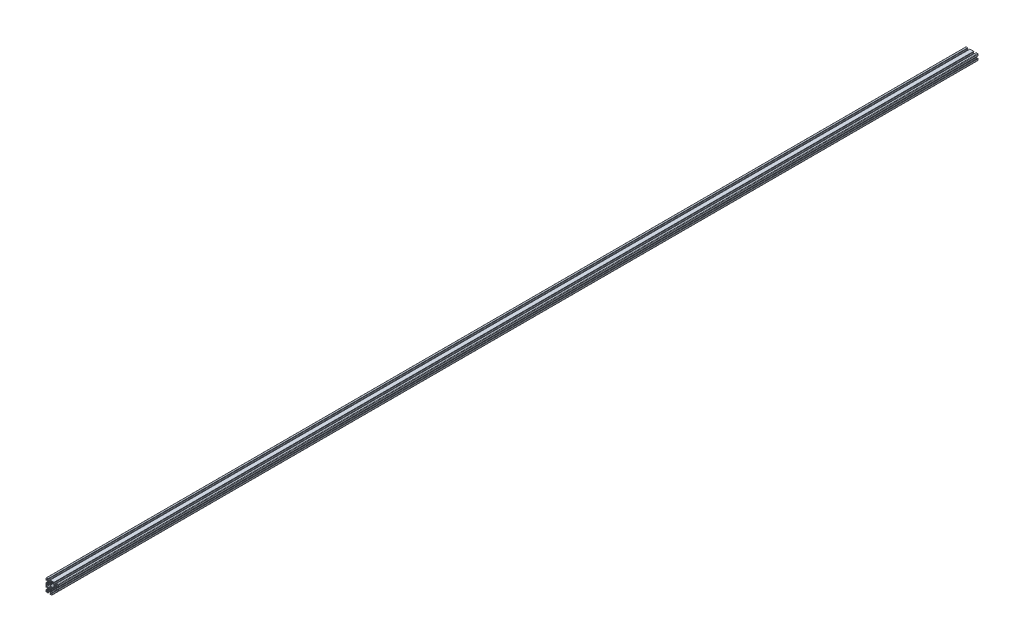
from build123d import *

# Parameters (mm, degrees)
EXTRUDE1_DEPTH = 3000


with BuildPart() as part:
    # Sketch1 → Extrude1 (new body)
    with BuildSketch(Plane.XY):
        with BuildLine():
            ThreePointArc((-3.349999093, 9.500000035), (-3.491420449, 9.558578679), (-3.549999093, 9.700000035))
            Line((-3.549999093, 9.700000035), (-3.549999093, 9.8))
            ThreePointArc((-3.549999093, 9.8), (-3.608577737, 9.941421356), (-3.749999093, 10))
            Line((-3.749999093, 10), (-8.5, 10))
            ThreePointArc((-8.5, 10), (-9.560660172, 9.560660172), (-10, 8.5))
            Line((-10, 8.5), (-10, 3.74999686))
            ThreePointArc((-10, 3.74999686), (-9.941421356, 3.608575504), (-9.8, 3.54999686))
            Line((-9.8, 3.54999686), (-9.699999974, 3.54999686))
            ThreePointArc((-9.699999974, 3.54999686), (-9.558578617, 3.491418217), (-9.499999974, 3.34999686))
            Line((-9.499999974, 3.34999686), (-9.499999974, 3.2))
            ThreePointArc((-9.499999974, 3.2), (-9.44142133, 3.058578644), (-9.299999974, 3))
            Line((-9.299999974, 3), (-9.000000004, 3))
            ThreePointArc((-9.000000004, 3), (-8.646446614, 3.146446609), (-8.500000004, 3.5))
            Line((-8.500000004, 3.5), (-8.500000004, 5.499996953))
            ThreePointArc((-8.500000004, 5.499996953), (-8.353553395, 5.853550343), (-8.000000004, 5.999996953))
            Line((-8.000000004, 5.999996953), (-7.267766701, 5.999996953))
            ThreePointArc((-7.267766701, 5.999996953), (-7.076425, 5.961936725), (-6.914213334, 5.853550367))
            Line((-6.914213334, 5.853550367), (-4.646446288, 3.58578362))
            ThreePointArc((-4.646446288, 3.58578362), (-4.538059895, 3.423571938), (-4.499999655, 3.232230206))
            Line((-4.499999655, 3.232230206), (-4.499999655, 0.953586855))
            ThreePointArc((-4.499999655, 0.953586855), (-4.493184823, 0.901823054), (-4.473204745, 0.85358687))
            Line((-4.473204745, 0.85358687), (-4.038120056, 0.099997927))
            ThreePointArc((-4.038120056, 0.099997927), (-4.011325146, -2.058e-06), (-4.038120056, -0.100002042))
            Line((-4.038120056, -0.100002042), (-4.473204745, -0.853590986))
            ThreePointArc((-4.473204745, -0.853590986), (-4.493184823, -0.90182717), (-4.499999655, -0.95359097))
            Line((-4.499999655, -0.95359097), (-4.499999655, -3.232234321))
            ThreePointArc((-4.499999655, -3.232234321), (-4.538059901, -3.423576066), (-4.646446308, -3.585787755))
            Line((-4.646446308, -3.585787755), (-6.91421348, -5.853554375))
            ThreePointArc((-6.91421348, -5.853554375), (-7.076425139, -5.961940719), (-7.267766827, -6.000000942))
            Line((-7.267766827, -6.000000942), (-8.000000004, -6.000000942))
            ThreePointArc((-8.000000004, -6.000000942), (-8.353553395, -5.853554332), (-8.500000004, -5.500000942))
            Line((-8.500000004, -5.500000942), (-8.500000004, -3.5))
            ThreePointArc((-8.500000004, -3.5), (-8.646446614, -3.146446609), (-9.000000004, -3))
            Line((-9.000000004, -3), (-9.299999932, -3))
            ThreePointArc((-9.299999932, -3), (-9.441421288, -3.058578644), (-9.499999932, -3.2))
            Line((-9.499999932, -3.2), (-9.499999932, -3.350000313))
            ThreePointArc((-9.499999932, -3.350000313), (-9.558578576, -3.491421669), (-9.699999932, -3.550000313))
            Line((-9.699999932, -3.550000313), (-9.8, -3.550000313))
            ThreePointArc((-9.8, -3.550000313), (-9.941421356, -3.608578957), (-10, -3.750000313))
            Line((-10, -3.750000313), (-10, -16.250001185))
            ThreePointArc((-10, -16.250001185), (-9.941421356, -16.391422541), (-9.8, -16.450001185))
            Line((-9.8, -16.450001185), (-9.699999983, -16.450001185))
            ThreePointArc((-9.699999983, -16.450001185), (-9.558578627, -16.508579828), (-9.499999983, -16.650001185))
            Line((-9.499999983, -16.650001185), (-9.499999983, -16.8))
            ThreePointArc((-9.499999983, -16.8), (-9.44142134, -16.941421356), (-9.299999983, -17))
            Line((-9.299999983, -17), (-9.000000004, -17))
            ThreePointArc((-9.000000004, -17), (-8.646446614, -16.853553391), (-8.500000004, -16.5))
            Line((-8.500000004, -16.5), (-8.500000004, -14.500001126))
            ThreePointArc((-8.500000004, -14.500001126), (-8.353553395, -14.146447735), (-8.000000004, -14.000001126))
            Line((-8.000000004, -14.000001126), (-7.267766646, -14.000001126))
            ThreePointArc((-7.267766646, -14.000001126), (-7.07642494, -14.038061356), (-6.91421327, -14.146447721))
            Line((-6.91421327, -14.146447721), (-4.646446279, -16.414214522))
            ThreePointArc((-4.646446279, -16.414214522), (-4.538059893, -16.576426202), (-4.499999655, -16.767767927))
            Line((-4.499999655, -16.767767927), (-4.499999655, -19.046411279))
            ThreePointArc((-4.499999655, -19.046411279), (-4.493184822, -19.098175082), (-4.473204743, -19.146411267))
            Line((-4.473204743, -19.146411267), (-4.038120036, -19.9000002))
            ThreePointArc((-4.038120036, -19.9000002), (-4.011325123, -20.000000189), (-4.038120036, -20.100000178))
            Line((-4.038120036, -20.100000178), (-4.473204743, -20.853589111))
            ThreePointArc((-4.473204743, -20.853589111), (-4.493184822, -20.901825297), (-4.499999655, -20.953589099))
            Line((-4.499999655, -20.953589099), (-4.499999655, -23.232232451))
            ThreePointArc((-4.499999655, -23.232232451), (-4.53805988, -23.423574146), (-4.646446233, -23.585785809))
            Line((-4.646446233, -23.585785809), (-6.914212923, -25.853552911))
            ThreePointArc((-6.914212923, -25.853552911), (-7.076424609, -25.96193931), (-7.267766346, -25.999999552))
            Line((-7.267766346, -25.999999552), (-8.000000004, -25.999999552))
            ThreePointArc((-8.000000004, -25.999999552), (-8.353553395, -25.853552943), (-8.500000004, -25.499999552))
            Line((-8.500000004, -25.499999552), (-8.500000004, -23.5))
            ThreePointArc((-8.500000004, -23.5), (-8.646446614, -23.146446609), (-9.000000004, -23))
            Line((-9.000000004, -23), (-9.300000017, -23))
            ThreePointArc((-9.300000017, -23), (-9.441421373, -23.058578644), (-9.500000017, -23.2))
            Line((-9.500000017, -23.2), (-9.500000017, -23.349999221))
            ThreePointArc((-9.500000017, -23.349999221), (-9.55857866, -23.491420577), (-9.700000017, -23.549999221))
            Line((-9.700000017, -23.549999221), (-9.8, -23.549999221))
            ThreePointArc((-9.8, -23.549999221), (-9.941421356, -23.608577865), (-10, -23.749999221))
            Line((-10, -23.749999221), (-10, -28.5))
            ThreePointArc((-10, -28.5), (-9.560660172, -29.560660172), (-8.5, -30))
            Line((-8.5, -30), (-3.7, -30))
            ThreePointArc((-3.7, -30), (-3.558578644, -29.941421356), (-3.5, -29.8))
            Line((-3.5, -29.8), (-3.5, -29.700000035))
            ThreePointArc((-3.5, -29.700000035), (-3.441421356, -29.558578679), (-3.3, -29.500000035))
            Line((-3.3, -29.500000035), (-3.2, -29.500000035))
            ThreePointArc((-3.2, -29.500000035), (-3.058578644, -29.441421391), (-3, -29.300000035))
            Line((-3, -29.300000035), (-3, -28.999999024))
            ThreePointArc((-3, -28.999999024), (-3.146446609, -28.646445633), (-3.5, -28.499999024))
            Line((-3.5, -28.499999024), (-5.499999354, -28.499999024))
            ThreePointArc((-5.499999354, -28.499999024), (-5.853552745, -28.353552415), (-5.999999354, -27.999999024))
            Line((-5.999999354, -27.999999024), (-5.999999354, -27.267766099))
            ThreePointArc((-5.999999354, -27.267766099), (-5.961939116, -27.076424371), (-5.853552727, -26.914212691))
            Line((-5.853552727, -26.914212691), (-3.585785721, -24.646445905))
            ThreePointArc((-3.585785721, -24.646445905), (-3.423574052, -24.538059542), (-3.232232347, -24.499999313))
            Line((-3.232232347, -24.499999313), (-0.953588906, -24.499999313))
            ThreePointArc((-0.953588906, -24.499999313), (-0.9018251, -24.493184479), (-0.853588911, -24.473204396))
            Line((-0.853588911, -24.473204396), (-0.099999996, -24.038119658))
            ThreePointArc((-0.099999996, -24.038119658), (5e-09, -24.011324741), (0.100000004, -24.038119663))
            Line((0.100000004, -24.038119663), (0.853588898, -24.473204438))
            ThreePointArc((0.853588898, -24.473204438), (0.901825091, -24.493184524), (0.953588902, -24.49999936))
            Line((0.953588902, -24.49999936), (3.232232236, -24.49999936))
            ThreePointArc((3.232232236, -24.49999936), (3.423573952, -24.538059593), (3.585785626, -24.646445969))
            Line((3.585785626, -24.646445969), (5.853552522, -26.914212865))
            ThreePointArc((5.853552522, -26.914212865), (5.961938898, -27.07642454), (5.999999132, -27.267766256))
            Line((5.999999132, -27.267766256), (5.999999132, -27.999999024))
            ThreePointArc((5.999999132, -27.999999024), (5.853552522, -28.353552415), (5.499999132, -28.499999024))
            Line((5.499999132, -28.499999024), (3.5, -28.499999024))
            ThreePointArc((3.5, -28.499999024), (3.146446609, -28.646445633), (3, -28.999999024))
            Line((3, -28.999999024), (3, -29.299999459))
            ThreePointArc((3, -29.299999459), (3.058578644, -29.441420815), (3.2, -29.499999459))
            Line((3.2, -29.499999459), (3.299999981, -29.499999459))
            ThreePointArc((3.299999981, -29.499999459), (3.441421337, -29.558578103), (3.499999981, -29.699999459))
            Line((3.499999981, -29.699999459), (3.499999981, -29.8))
            ThreePointArc((3.499999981, -29.8), (3.558578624, -29.941421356), (3.699999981, -30))
            Line((3.699999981, -30), (8.5, -30))
            ThreePointArc((8.5, -30), (9.560660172, -29.560660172), (10, -28.5))
            Line((10, -28.5), (10, -23.700000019))
            ThreePointArc((10, -23.700000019), (9.941421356, -23.558578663), (9.8, -23.500000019))
            Line((9.8, -23.500000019), (9.700000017, -23.500000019))
            ThreePointArc((9.700000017, -23.500000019), (9.55857866, -23.441421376), (9.500000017, -23.300000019))
            Line((9.500000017, -23.300000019), (9.500000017, -23.2))
            ThreePointArc((9.500000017, -23.2), (9.441421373, -23.058578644), (9.300000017, -23))
            Line((9.300000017, -23), (9.000000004, -23))
            ThreePointArc((9.000000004, -23), (8.646446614, -23.146446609), (8.500000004, -23.5))
            Line((8.500000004, -23.5), (8.500000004, -25.499999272))
            ThreePointArc((8.500000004, -25.499999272), (8.353553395, -25.853552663), (8.000000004, -25.999999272))
            Line((8.000000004, -25.999999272), (7.267766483, -25.999999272))
            ThreePointArc((7.267766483, -25.999999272), (7.076424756, -25.961939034), (6.914213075, -25.853552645))
            Line((6.914213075, -25.853552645), (4.64644629, -23.585785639))
            ThreePointArc((4.64644629, -23.585785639), (4.538059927, -23.42357397), (4.499999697, -23.232232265))
            Line((4.499999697, -23.232232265), (4.499999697, -20.953588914))
            ThreePointArc((4.499999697, -20.953588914), (4.493184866, -20.901825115), (4.473204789, -20.853588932))
            Line((4.473204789, -20.853588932), (4.038120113, -20.099999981))
            ThreePointArc((4.038120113, -20.099999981), (4.011325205, -20), (4.038120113, -19.900000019))
            Line((4.038120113, -19.900000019), (4.473204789, -19.146411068))
            ThreePointArc((4.473204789, -19.146411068), (4.493184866, -19.098174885), (4.499999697, -19.046411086))
            Line((4.499999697, -19.046411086), (4.499999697, -16.767767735))
            ThreePointArc((4.499999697, -16.767767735), (4.538059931, -16.576426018), (4.646446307, -16.414214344))
            Line((4.646446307, -16.414214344), (6.914213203, -14.146447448))
            ThreePointArc((6.914213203, -14.146447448), (7.076424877, -14.038061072), (7.267766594, -14.000000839))
            Line((7.267766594, -14.000000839), (8.000000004, -14.000000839))
            ThreePointArc((8.000000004, -14.000000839), (8.353553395, -14.146447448), (8.500000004, -14.500000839))
            Line((8.500000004, -14.500000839), (8.500000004, -16.5))
            ThreePointArc((8.500000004, -16.5), (8.646446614, -16.853553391), (9.000000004, -17))
            Line((9.000000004, -17), (9.299999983, -17))
            ThreePointArc((9.299999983, -17), (9.44142134, -16.941421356), (9.499999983, -16.8))
            Line((9.499999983, -16.8), (9.499999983, -16.700000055))
            ThreePointArc((9.499999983, -16.700000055), (9.558578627, -16.558578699), (9.699999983, -16.500000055))
            Line((9.699999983, -16.500000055), (9.8, -16.500000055))
            ThreePointArc((9.8, -16.500000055), (9.941421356, -16.441421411), (10, -16.300000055))
            Line((10, -16.300000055), (10, -11.5))
            ThreePointArc((10, -11.5), (10.439339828, -10.439339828), (11.5, -10))
            Line((11.5, -10), (16.250000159, -10))
            ThreePointArc((16.250000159, -10), (16.391421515, -9.941421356), (16.450000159, -9.8))
            Line((16.450000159, -9.8), (16.450000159, -9.699999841))
            ThreePointArc((16.450000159, -9.699999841), (16.508578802, -9.558578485), (16.650000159, -9.499999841))
            Line((16.650000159, -9.499999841), (16.8, -9.499999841))
            ThreePointArc((16.8, -9.499999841), (16.941421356, -9.441421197), (17, -9.299999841))
            Line((17, -9.299999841), (17, -8.999999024))
            ThreePointArc((17, -8.999999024), (16.853553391, -8.646445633), (16.5, -8.499999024))
            Line((16.5, -8.499999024), (14.500002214, -8.499999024))
            ThreePointArc((14.500002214, -8.499999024), (14.146448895, -8.353552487), (14.000002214, -7.999999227))
            Line((14.000002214, -7.999999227), (14.000001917, -7.267767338))
            ThreePointArc((14.000001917, -7.267767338), (14.038062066, -7.076425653), (14.146448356, -6.914213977))
            Line((14.146448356, -6.914213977), (16.414214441, -4.646446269))
            ThreePointArc((16.414214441, -4.646446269), (16.576426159, -4.538059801), (16.767767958, -4.499999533))
            Line((16.767767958, -4.499999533), (19.046411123, -4.499999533))
            ThreePointArc((19.046411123, -4.499999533), (19.098174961, -4.493184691), (19.146411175, -4.473204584))
            Line((19.146411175, -4.473204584), (19.899999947, -4.038119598))
            ThreePointArc((19.899999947, -4.038119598), (20, -4.011324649), (20.100000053, -4.038119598))
            Line((20.100000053, -4.038119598), (20.853588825, -4.473204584))
            ThreePointArc((20.853588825, -4.473204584), (20.901825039, -4.493184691), (20.953588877, -4.499999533))
            Line((20.953588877, -4.499999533), (23.232232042, -4.499999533))
            ThreePointArc((23.232232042, -4.499999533), (23.423573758, -4.538059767), (23.585785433, -4.646446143))
            Line((23.585785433, -4.646446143), (25.853552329, -6.914213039))
            ThreePointArc((25.853552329, -6.914213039), (25.961938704, -7.076424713), (25.999998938, -7.26776643))
            Line((25.999998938, -7.26776643), (25.999998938, -7.999999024))
            ThreePointArc((25.999998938, -7.999999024), (25.853552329, -8.353552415), (25.499998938, -8.499999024))
            Line((25.499998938, -8.499999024), (23.5, -8.499999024))
            ThreePointArc((23.5, -8.499999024), (23.146446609, -8.646445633), (23, -8.999999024))
            Line((23, -8.999999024), (23, -9.3))
            ThreePointArc((23, -9.3), (23.058578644, -9.441421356), (23.2, -9.5))
            Line((23.2, -9.5), (23.3, -9.5))
            ThreePointArc((23.3, -9.5), (23.441421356, -9.558578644), (23.5, -9.7))
            Line((23.5, -9.7), (23.5, -9.8))
            ThreePointArc((23.5, -9.8), (23.558578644, -9.941421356), (23.7, -10))
            Line((23.7, -10), (28.5, -10))
            ThreePointArc((28.5, -10), (29.560660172, -9.560660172), (30, -8.5))
            Line((30, -8.5), (30, -3.699999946))
            ThreePointArc((30, -3.699999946), (29.941421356, -3.55857859), (29.8, -3.499999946))
            Line((29.8, -3.499999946), (29.699999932, -3.499999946))
            ThreePointArc((29.699999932, -3.499999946), (29.558578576, -3.441421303), (29.499999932, -3.299999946))
            Line((29.499999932, -3.299999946), (29.499999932, -3.2))
            ThreePointArc((29.499999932, -3.2), (29.441421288, -3.058578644), (29.299999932, -3))
            Line((29.299999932, -3), (29.000000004, -3))
            ThreePointArc((29.000000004, -3), (28.646446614, -3.146446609), (28.500000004, -3.5))
            Line((28.500000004, -3.5), (28.500000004, -5.499999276))
            ThreePointArc((28.500000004, -5.499999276), (28.353553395, -5.853552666), (28.000000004, -5.999999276))
            Line((28.000000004, -5.999999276), (27.26776694, -5.999999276))
            ThreePointArc((27.26776694, -5.999999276), (27.076425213, -5.961939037), (26.914213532, -5.853552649))
            Line((26.914213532, -5.853552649), (24.646446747, -3.585785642))
            ThreePointArc((24.646446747, -3.585785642), (24.538060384, -3.423573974), (24.500000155, -3.232232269))
            Line((24.500000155, -3.232232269), (24.500000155, -0.953588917))
            ThreePointArc((24.500000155, -0.953588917), (24.493185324, -0.901825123), (24.47320525, -0.853588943))
            Line((24.47320525, -0.853588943), (24.038120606, -0.099999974))
            ThreePointArc((24.038120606, -0.099999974), (24.011325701, 0), (24.038120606, 0.099999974))
            Line((24.038120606, 0.099999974), (24.47320525, 0.853588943))
            ThreePointArc((24.47320525, 0.853588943), (24.493185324, 0.901825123), (24.500000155, 0.953588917))
            Line((24.500000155, 0.953588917), (24.500000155, 3.232232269))
            ThreePointArc((24.500000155, 3.232232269), (24.538060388, 3.423573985), (24.646446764, 3.58578566))
            Line((24.646446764, 3.58578566), (26.91421366, 5.853552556))
            ThreePointArc((26.91421366, 5.853552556), (27.076425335, 5.961938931), (27.267767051, 5.999999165))
            Line((27.267767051, 5.999999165), (28.000000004, 5.999999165))
            ThreePointArc((28.000000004, 5.999999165), (28.353553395, 5.853552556), (28.500000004, 5.499999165))
            Line((28.500000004, 5.499999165), (28.500000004, 3.5))
            ThreePointArc((28.500000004, 3.5), (28.646446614, 3.146446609), (29.000000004, 3))
            Line((29.000000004, 3), (29.299999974, 3))
            ThreePointArc((29.299999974, 3), (29.44142133, 3.058578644), (29.499999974, 3.2))
            Line((29.499999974, 3.2), (29.499999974, 3.3))
            ThreePointArc((29.499999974, 3.3), (29.558578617, 3.441421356), (29.699999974, 3.5))
            Line((29.699999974, 3.5), (29.8, 3.5))
            ThreePointArc((29.8, 3.5), (29.941421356, 3.558578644), (30, 3.7))
            Line((30, 3.7), (30, 8.5))
            ThreePointArc((30, 8.5), (29.560660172, 9.560660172), (28.5, 10))
            Line((28.5, 10), (23.700000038, 10))
            ThreePointArc((23.700000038, 10), (23.558578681, 9.941421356), (23.500000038, 9.8))
            Line((23.500000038, 9.8), (23.500000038, 9.7))
            ThreePointArc((23.500000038, 9.7), (23.441421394, 9.558578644), (23.300000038, 9.5))
            Line((23.300000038, 9.5), (23.2, 9.5))
            ThreePointArc((23.2, 9.5), (23.058578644, 9.441421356), (23, 9.3))
            Line((23, 9.3), (23, 8.999999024))
            ThreePointArc((23, 8.999999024), (23.146446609, 8.646445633), (23.5, 8.499999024))
            Line((23.5, 8.499999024), (25.499997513, 8.499999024))
            ThreePointArc((25.499997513, 8.499999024), (25.853550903, 8.353552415), (25.999997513, 7.999999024))
            Line((25.999997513, 7.999999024), (25.999997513, 7.267767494))
            ThreePointArc((25.999997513, 7.267767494), (25.961937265, 7.076425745), (25.853550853, 6.914214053))
            Line((25.853550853, 6.914214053), (23.585783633, 4.64644748))
            ThreePointArc((23.585783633, 4.64644748), (23.423571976, 4.538061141), (23.232230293, 4.500000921))
            Line((23.232230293, 4.500000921), (20.953586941, 4.500000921))
            ThreePointArc((20.953586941, 4.500000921), (20.901823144, 4.49318609), (20.853586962, 4.473206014))
            Line((20.853586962, 4.473206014), (20.099998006, 4.038121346))
            ThreePointArc((20.099998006, 4.038121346), (19.999998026, 4.011326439), (19.899998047, 4.038121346))
            Line((19.899998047, 4.038121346), (19.146409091, 4.473206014))
            ThreePointArc((19.146409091, 4.473206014), (19.098172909, 4.49318609), (19.046409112, 4.500000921))
            Line((19.046409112, 4.500000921), (16.76776576, 4.500000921))
            ThreePointArc((16.76776576, 4.500000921), (16.576424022, 4.538061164), (16.414212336, 4.646447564))
            Line((16.414212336, 4.646447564), (14.146445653, 6.914214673))
            ThreePointArc((14.146445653, 6.914214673), (14.038059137, 7.076426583), (13.999998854, 7.267768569))
            Line((13.999998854, 7.267768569), (13.999998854, 7.999999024))
            ThreePointArc((13.999998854, 7.999999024), (14.146445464, 8.353552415), (14.499998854, 8.499999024))
            Line((14.499998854, 8.499999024), (16.5, 8.499999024))
            ThreePointArc((16.5, 8.499999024), (16.853553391, 8.646445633), (17, 8.999999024))
            Line((17, 8.999999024), (17, 9.299999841))
            ThreePointArc((17, 9.299999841), (16.941421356, 9.441421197), (16.8, 9.499999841))
            Line((16.8, 9.499999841), (16.599999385, 9.499999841))
            ThreePointArc((16.599999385, 9.499999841), (16.458578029, 9.558578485), (16.399999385, 9.699999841))
            Line((16.399999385, 9.699999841), (16.399999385, 9.799999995))
            ThreePointArc((16.399999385, 9.799999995), (16.341420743, 9.941421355), (16.199999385, 10))
            Line((16.199999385, 10), (3.700000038, 10))
            ThreePointArc((3.700000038, 10), (3.558578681, 9.941421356), (3.500000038, 9.8))
            Line((3.500000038, 9.8), (3.500000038, 9.699999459))
            ThreePointArc((3.500000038, 9.699999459), (3.441421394, 9.558578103), (3.300000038, 9.499999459))
            Line((3.300000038, 9.499999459), (3.2, 9.499999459))
            ThreePointArc((3.2, 9.499999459), (3.058578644, 9.441420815), (3, 9.299999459))
            Line((3, 9.299999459), (3, 8.999999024))
            ThreePointArc((3, 8.999999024), (3.146446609, 8.646445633), (3.5, 8.499999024))
            Line((3.5, 8.499999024), (5.499999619, 8.499999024))
            ThreePointArc((5.499999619, 8.499999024), (5.85355301, 8.353552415), (5.999999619, 7.999999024))
            Line((5.999999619, 7.999999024), (5.999999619, 7.267767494))
            ThreePointArc((5.999999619, 7.267767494), (5.961939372, 7.076425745), (5.853552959, 6.914214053))
            Line((5.853552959, 6.914214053), (3.585785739, 4.64644748))
            ThreePointArc((3.585785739, 4.64644748), (3.423574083, 4.538061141), (3.232232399, 4.500000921))
            Line((3.232232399, 4.500000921), (0.953589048, 4.500000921))
            ThreePointArc((0.953589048, 4.500000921), (0.90182525, 4.49318609), (0.853589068, 4.473206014))
            Line((0.853589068, 4.473206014), (0.100000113, 4.038121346))
            ThreePointArc((0.100000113, 4.038121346), (1.33e-07, 4.011326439), (-0.099999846, 4.038121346))
            Line((-0.099999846, 4.038121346), (-0.853588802, 4.473206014))
            ThreePointArc((-0.853588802, 4.473206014), (-0.901824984, 4.49318609), (-0.953588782, 4.500000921))
            Line((-0.953588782, 4.500000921), (-3.232232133, 4.500000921))
            ThreePointArc((-3.232232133, 4.500000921), (-3.423573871, 4.538061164), (-3.585785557, 4.646447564))
            Line((-3.585785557, 4.646447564), (-5.85355224, 6.914214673))
            ThreePointArc((-5.85355224, 6.914214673), (-5.961938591, 7.076426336), (-5.999998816, 7.267768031))
            Line((-5.999998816, 7.267768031), (-5.999998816, 7.999999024))
            ThreePointArc((-5.999998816, 7.999999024), (-5.853552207, 8.353552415), (-5.499998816, 8.499999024))
            Line((-5.499998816, 8.499999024), (-3.5, 8.499999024))
            ThreePointArc((-3.5, 8.499999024), (-3.146446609, 8.646445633), (-3, 8.999999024))
            Line((-3, 8.999999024), (-3, 9.300000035))
            ThreePointArc((-3, 9.300000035), (-3.058578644, 9.441421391), (-3.2, 9.500000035))
            Line((-3.2, 9.500000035), (-3.349999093, 9.500000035))
        make_face()
        with BuildLine():
            Line((2.891601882, 1.800596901), (2.525869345, 1.362297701))
            ThreePointArc((2.525869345, 1.362297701), (2.481166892, 1.260459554), (2.497774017, 1.150489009))
            ThreePointArc((2.497774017, 1.150489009), (2.75, 0), (2.497774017, -1.150489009))
            ThreePointArc((2.497774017, -1.150489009), (2.481166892, -1.260459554), (2.525869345, -1.362297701))
            Line((2.525869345, -1.362297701), (2.891601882, -1.800596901))
            ThreePointArc((2.891601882, -1.800596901), (2.937874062, -1.920565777), (2.90154698, -2.043910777))
            ThreePointArc((2.90154698, -2.043910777), (2.509635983, -2.509636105), (2.043910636, -2.90154708))
            ThreePointArc((2.043910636, -2.90154708), (1.920565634, -2.937874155), (1.80059676, -2.891601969))
            Line((1.80059676, -2.891601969), (1.362297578, -2.525869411))
            ThreePointArc((1.362297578, -2.525869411), (1.260459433, -2.481166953), (1.150488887, -2.497774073))
            ThreePointArc((1.150488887, -2.497774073), (0.003771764, -2.749997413), (-1.143632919, -2.50092058))
            ThreePointArc((-1.143632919, -2.50092058), (-1.253648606, -2.484615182), (-1.355363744, -2.529596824))
            Line((-1.355363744, -2.529596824), (-1.792658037, -2.896530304))
            ThreePointArc((-1.792658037, -2.896530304), (-1.91249953, -2.943131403), (-2.035943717, -2.907142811))
            ThreePointArc((-2.035943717, -2.907142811), (-2.506191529, -2.513075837), (-2.90154698, -2.043910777))
            ThreePointArc((-2.90154698, -2.043910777), (-2.937862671, -1.920291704), (-2.891249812, -1.80017615))
            Line((-2.891249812, -1.80017615), (-2.524316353, -1.362881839))
            ThreePointArc((-2.524316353, -1.362881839), (-2.480347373, -1.261339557), (-2.497095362, -1.151961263))
            ThreePointArc((-2.497095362, -1.151961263), (-2.74997358, 0.012054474), (-2.48690038, 1.173808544))
            ThreePointArc((-2.48690038, 1.173808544), (-2.481329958, 1.273149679), (-2.524316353, 1.362881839))
            Line((-2.524316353, 1.362881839), (-2.891249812, 1.80017615))
            ThreePointArc((-2.891249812, 1.80017615), (-2.937862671, 1.920291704), (-2.90154698, 2.043910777))
            ThreePointArc((-2.90154698, 2.043910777), (-2.509635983, 2.509636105), (-2.043910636, 2.90154708))
            ThreePointArc((-2.043910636, 2.90154708), (-1.920565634, 2.937874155), (-1.80059676, 2.891601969))
            Line((-1.80059676, 2.891601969), (-1.362297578, 2.525869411))
            ThreePointArc((-1.362297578, 2.525869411), (-1.260459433, 2.481166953), (-1.150488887, 2.497774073))
            ThreePointArc((-1.150488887, 2.497774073), (0, 2.75), (1.150488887, 2.497774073))
            ThreePointArc((1.150488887, 2.497774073), (1.260459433, 2.481166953), (1.362297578, 2.525869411))
            Line((1.362297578, 2.525869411), (1.80059676, 2.891601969))
            ThreePointArc((1.80059676, 2.891601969), (1.920565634, 2.937874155), (2.043910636, 2.90154708))
            ThreePointArc((2.043910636, 2.90154708), (2.509635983, 2.509636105), (2.90154698, 2.043910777))
            ThreePointArc((2.90154698, 2.043910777), (2.937874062, 1.920565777), (2.891601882, 1.800596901))
        make_face(mode=Mode.SUBTRACT)
        with BuildLine():
            Line((-1.80059676, -17.108398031), (-1.362297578, -17.474130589))
            ThreePointArc((-1.362297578, -17.474130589), (-1.260459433, -17.518833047), (-1.150488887, -17.502225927))
            ThreePointArc((-1.150488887, -17.502225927), (1.34e-07, -17.25), (1.150489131, -17.502226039))
            ThreePointArc((1.150489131, -17.502226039), (1.260459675, -17.51883317), (1.362297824, -17.474130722))
            Line((1.362297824, -17.474130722), (1.800597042, -17.108398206))
            ThreePointArc((1.800597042, -17.108398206), (1.92056592, -17.062126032), (2.043910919, -17.098453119))
            ThreePointArc((2.043910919, -17.098453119), (2.509636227, -17.49036414), (2.901547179, -17.956089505))
            ThreePointArc((2.901547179, -17.956089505), (2.937874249, -18.079434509), (2.891602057, -18.199403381))
            Line((2.891602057, -18.199403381), (2.525869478, -18.637702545))
            ThreePointArc((2.525869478, -18.637702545), (2.481167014, -18.739540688), (2.497774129, -18.849511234))
            ThreePointArc((2.497774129, -18.849511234), (2.75, -20.000000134), (2.497774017, -21.150489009))
            ThreePointArc((2.497774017, -21.150489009), (2.481166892, -21.260459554), (2.525869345, -21.362297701))
            Line((2.525869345, -21.362297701), (2.891601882, -21.800596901))
            ThreePointArc((2.891601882, -21.800596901), (2.937874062, -21.920565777), (2.90154698, -22.043910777))
            ThreePointArc((2.90154698, -22.043910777), (2.509635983, -22.509636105), (2.043910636, -22.90154708))
            ThreePointArc((2.043910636, -22.90154708), (1.920565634, -22.937874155), (1.80059676, -22.891601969))
            Line((1.80059676, -22.891601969), (1.362297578, -22.525869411))
            ThreePointArc((1.362297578, -22.525869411), (1.260459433, -22.481166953), (1.150488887, -22.497774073))
            ThreePointArc((1.150488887, -22.497774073), (-1.34e-07, -22.75), (-1.150489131, -22.497773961))
            ThreePointArc((-1.150489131, -22.497773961), (-1.260459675, -22.48116683), (-1.362297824, -22.525869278))
            Line((-1.362297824, -22.525869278), (-1.800597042, -22.891601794))
            ThreePointArc((-1.800597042, -22.891601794), (-1.92056592, -22.937873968), (-2.043910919, -22.901546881))
            ThreePointArc((-2.043910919, -22.901546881), (-2.509636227, -22.50963586), (-2.901547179, -22.043910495))
            ThreePointArc((-2.901547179, -22.043910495), (-2.937874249, -21.920565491), (-2.891602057, -21.800596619))
            Line((-2.891602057, -21.800596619), (-2.525869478, -21.362297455))
            ThreePointArc((-2.525869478, -21.362297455), (-2.481167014, -21.260459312), (-2.497774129, -21.150488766))
            ThreePointArc((-2.497774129, -21.150488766), (-2.75, -19.999999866), (-2.497774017, -18.849510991))
            ThreePointArc((-2.497774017, -18.849510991), (-2.481166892, -18.739540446), (-2.525869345, -18.637702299))
            Line((-2.525869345, -18.637702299), (-2.891601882, -18.199403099))
            ThreePointArc((-2.891601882, -18.199403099), (-2.937874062, -18.079434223), (-2.90154698, -17.956089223))
            ThreePointArc((-2.90154698, -17.956089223), (-2.509635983, -17.490363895), (-2.043910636, -17.09845292))
            ThreePointArc((-2.043910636, -17.09845292), (-1.920565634, -17.062125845), (-1.80059676, -17.108398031))
        make_face(mode=Mode.SUBTRACT)
        with BuildLine():
            ThreePointArc((-3.585784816, -4.646446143), (-3.423573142, -4.538059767), (-3.232231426, -4.499999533))
            Line((-3.232231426, -4.499999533), (-0.953588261, -4.499999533))
            ThreePointArc((-0.953588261, -4.499999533), (-0.901824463, -4.493184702), (-0.853588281, -4.473204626))
            Line((-0.853588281, -4.473204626), (-0.099999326, -4.038119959))
            ThreePointArc((-0.099999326, -4.038119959), (6.54e-07, -4.011325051), (0.100000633, -4.038119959))
            Line((0.100000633, -4.038119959), (0.853589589, -4.473204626))
            ThreePointArc((0.853589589, -4.473204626), (0.901825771, -4.493184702), (0.953589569, -4.499999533))
            Line((0.953589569, -4.499999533), (3.232232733, -4.499999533))
            ThreePointArc((3.232232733, -4.499999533), (3.423574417, -4.538059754), (3.585786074, -4.646446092))
            Line((3.585786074, -4.646446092), (8.353553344, -9.414212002))
            ThreePointArc((8.353553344, -9.414212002), (8.461939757, -9.576423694), (8.500000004, -9.767765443))
            Line((8.500000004, -9.767765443), (8.500000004, -12.000000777))
            ThreePointArc((8.500000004, -12.000000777), (8.353553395, -12.353554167), (8.000000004, -12.500000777))
            Line((8.000000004, -12.500000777), (7.267766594, -12.500000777))
            ThreePointArc((7.267766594, -12.500000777), (6.502399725, -12.652241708), (5.853553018, -13.085787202))
            Line((5.853553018, -13.085787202), (3.585784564, -15.353555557))
            ThreePointArc((3.585784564, -15.353555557), (3.423572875, -15.461941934), (3.232231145, -15.500002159))
            Line((3.232231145, -15.500002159), (0.953590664, -15.500001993))
            ThreePointArc((0.953590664, -15.500001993), (0.901826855, -15.506816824), (0.853590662, -15.526796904))
            Line((0.853590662, -15.526796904), (0.100001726, -15.961881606))
            ThreePointArc((0.100001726, -15.961881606), (1.724e-06, -15.988676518), (-0.099998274, -15.961881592))
            Line((-0.099998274, -15.961881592), (-0.853587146, -15.52679678))
            ThreePointArc((-0.853587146, -15.52679678), (-0.90182338, -15.50681668), (-0.953587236, -15.500001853))
            Line((-0.953587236, -15.500001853), (-3.232231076, -15.500002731))
            ThreePointArc((-3.232231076, -15.500002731), (-3.423572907, -15.461942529), (-3.585784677, -15.353556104))
            Line((-3.585784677, -15.353556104), (-5.853552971, -13.085787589))
            ThreePointArc((-5.853552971, -13.085787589), (-6.502399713, -12.652242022), (-7.267766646, -12.500001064))
            Line((-7.267766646, -12.500001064), (-8.000000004, -12.500001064))
            ThreePointArc((-8.000000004, -12.500001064), (-8.353553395, -12.353554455), (-8.500000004, -12.000001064))
            Line((-8.500000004, -12.000001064), (-8.500000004, -8.000001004))
            ThreePointArc((-8.500000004, -8.000001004), (-8.353553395, -7.646447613), (-8.000000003, -7.500001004))
            Line((-8.000000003, -7.500001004), (-7.267766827, -7.500001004))
            ThreePointArc((-7.267766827, -7.500001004), (-6.502399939, -7.347760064), (-5.853553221, -6.914214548))
            Line((-5.853553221, -6.914214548), (-3.585784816, -4.646446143))
        make_face(mode=Mode.SUBTRACT)
        with BuildLine():
            ThreePointArc((17.09845302, 2.043910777), (17.490364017, 2.509636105), (17.956089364, 2.90154708))
            ThreePointArc((17.956089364, 2.90154708), (18.07970844, 2.937862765), (18.199823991, 2.8912499))
            Line((18.199823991, 2.8912499), (18.642781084, 2.531172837))
            ThreePointArc((18.642781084, 2.531172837), (18.745145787, 2.484782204), (18.856367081, 2.50092058))
            ThreePointArc((18.856367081, 2.50092058), (20, 2.75), (21.143632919, 2.50092058))
            ThreePointArc((21.143632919, 2.50092058), (21.253648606, 2.484615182), (21.355363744, 2.529596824))
            Line((21.355363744, 2.529596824), (21.798320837, 2.889673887))
            ThreePointArc((21.798320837, 2.889673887), (21.919075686, 2.93780769), (22.043910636, 2.90154708))
            ThreePointArc((22.043910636, 2.90154708), (22.509635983, 2.509636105), (22.90154698, 2.043910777))
            ThreePointArc((22.90154698, 2.043910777), (22.937807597, 1.919075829), (22.8896738, 1.798320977))
            Line((22.8896738, 1.798320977), (22.529596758, 1.355363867))
            ThreePointArc((22.529596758, 1.355363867), (22.484615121, 1.253648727), (22.500920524, 1.143633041))
            ThreePointArc((22.500920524, 1.143633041), (22.75, 0), (22.500920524, -1.143633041))
            ThreePointArc((22.500920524, -1.143633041), (22.484615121, -1.253648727), (22.529596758, -1.355363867))
            Line((22.529596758, -1.355363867), (22.8896738, -1.798320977))
            ThreePointArc((22.8896738, -1.798320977), (22.937807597, -1.919075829), (22.90154698, -2.043910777))
            ThreePointArc((22.90154698, -2.043910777), (22.509635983, -2.509636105), (22.043910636, -2.90154708))
            ThreePointArc((22.043910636, -2.90154708), (21.919075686, -2.93780769), (21.798320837, -2.889673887))
            Line((21.798320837, -2.889673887), (21.355363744, -2.529596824))
            ThreePointArc((21.355363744, -2.529596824), (21.253648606, -2.484615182), (21.143632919, -2.50092058))
            ThreePointArc((21.143632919, -2.50092058), (20, -2.75), (18.856367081, -2.50092058))
            ThreePointArc((18.856367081, -2.50092058), (18.745145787, -2.484782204), (18.642781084, -2.531172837))
            Line((18.642781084, -2.531172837), (18.199823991, -2.8912499))
            ThreePointArc((18.199823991, -2.8912499), (18.07970844, -2.937862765), (17.956089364, -2.90154708))
            ThreePointArc((17.956089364, -2.90154708), (17.490364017, -2.509636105), (17.09845302, -2.043910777))
            ThreePointArc((17.09845302, -2.043910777), (17.062137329, -1.920291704), (17.108750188, -1.80017615))
            Line((17.108750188, -1.80017615), (17.468827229, -1.35721904))
            ThreePointArc((17.468827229, -1.35721904), (17.515217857, -1.254854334), (17.499079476, -1.143633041))
            ThreePointArc((17.499079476, -1.143633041), (17.25, 0), (17.499079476, 1.143633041))
            ThreePointArc((17.499079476, 1.143633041), (17.515217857, 1.254854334), (17.468827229, 1.35721904))
            Line((17.468827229, 1.35721904), (17.108750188, 1.80017615))
            ThreePointArc((17.108750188, 1.80017615), (17.062137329, 1.920291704), (17.09845302, 2.043910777))
        make_face(mode=Mode.SUBTRACT)
        with BuildLine():
            Line((4.499999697, 0.953588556), (4.499999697, 3.232231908))
            ThreePointArc((4.499999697, 3.232231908), (4.538059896, 3.423573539), (4.646446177, 3.585785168))
            Line((4.646446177, 3.585785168), (6.914213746, 5.853554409))
            ThreePointArc((6.914213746, 5.853554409), (7.347758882, 6.502400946), (7.499999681, 7.267767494))
            Line((7.499999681, 7.267767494), (7.499999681, 7.999999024))
            ThreePointArc((7.499999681, 7.999999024), (7.646446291, 8.353552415), (7.999999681, 8.499999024))
            Line((7.999999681, 8.499999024), (11.999999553, 8.499999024))
            ThreePointArc((11.999999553, 8.499999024), (12.353552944, 8.353552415), (12.499999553, 7.999999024))
            Line((12.499999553, 7.999999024), (12.499999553, 7.267768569))
            ThreePointArc((12.499999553, 7.267768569), (12.652240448, 6.502401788), (13.085785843, 5.853555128))
            Line((13.085785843, 5.853555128), (15.353553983, 3.585786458))
            ThreePointArc((15.353553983, 3.585786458), (15.461940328, 3.423574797), (15.500000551, 3.232233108))
            Line((15.500000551, 3.232233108), (15.500000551, 0.953589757))
            ThreePointArc((15.500000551, 0.953589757), (15.506815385, 0.901825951), (15.526795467, 0.853589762))
            Line((15.526795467, 0.853589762), (15.961880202, 0.100000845))
            ThreePointArc((15.961880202, 0.100000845), (15.988675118, 8.5e-07), (15.961880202, -0.099999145))
            Line((15.961880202, -0.099999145), (15.526795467, -0.853588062))
            ThreePointArc((15.526795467, -0.853588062), (15.506815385, -0.901824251), (15.500000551, -0.953588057))
            Line((15.500000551, -0.953588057), (15.500000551, -3.232231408))
            ThreePointArc((15.500000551, -3.232231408), (15.461940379, -3.423572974), (15.353554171, -3.585784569))
            Line((15.353554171, -3.585784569), (13.085787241, -5.853554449))
            ThreePointArc((13.085787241, -5.853554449), (12.652242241, -6.502401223), (12.500001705, -7.267767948))
            Line((12.500001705, -7.267767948), (12.500002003, -7.999998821))
            ThreePointArc((12.500002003, -7.999998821), (12.353555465, -8.353552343), (12.000002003, -8.499999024))
            Line((12.000002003, -8.499999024), (9.767766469, -8.499999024))
            ThreePointArc((9.767766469, -8.499999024), (9.576424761, -8.461938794), (9.414213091, -8.353552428))
            Line((9.414213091, -8.353552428), (4.64644632, -3.585786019))
            ThreePointArc((4.64644632, -3.585786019), (4.538059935, -3.42357434), (4.499999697, -3.232232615))
            Line((4.499999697, -3.232232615), (4.499999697, -0.953589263))
            ThreePointArc((4.499999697, -0.953589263), (4.493184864, -0.90182546), (4.473204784, -0.853589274))
            Line((4.473204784, -0.853589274), (4.038120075, -0.100000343))
            ThreePointArc((4.038120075, -0.100000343), (4.011325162, -3.53e-07), (4.038120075, 0.099999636))
            Line((4.038120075, 0.099999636), (4.473204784, 0.853588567))
            ThreePointArc((4.473204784, 0.853588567), (4.493184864, 0.901824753), (4.499999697, 0.953588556))
        make_face(mode=Mode.SUBTRACT)
    extrude(amount=EXTRUDE1_DEPTH)


solid = part.part
